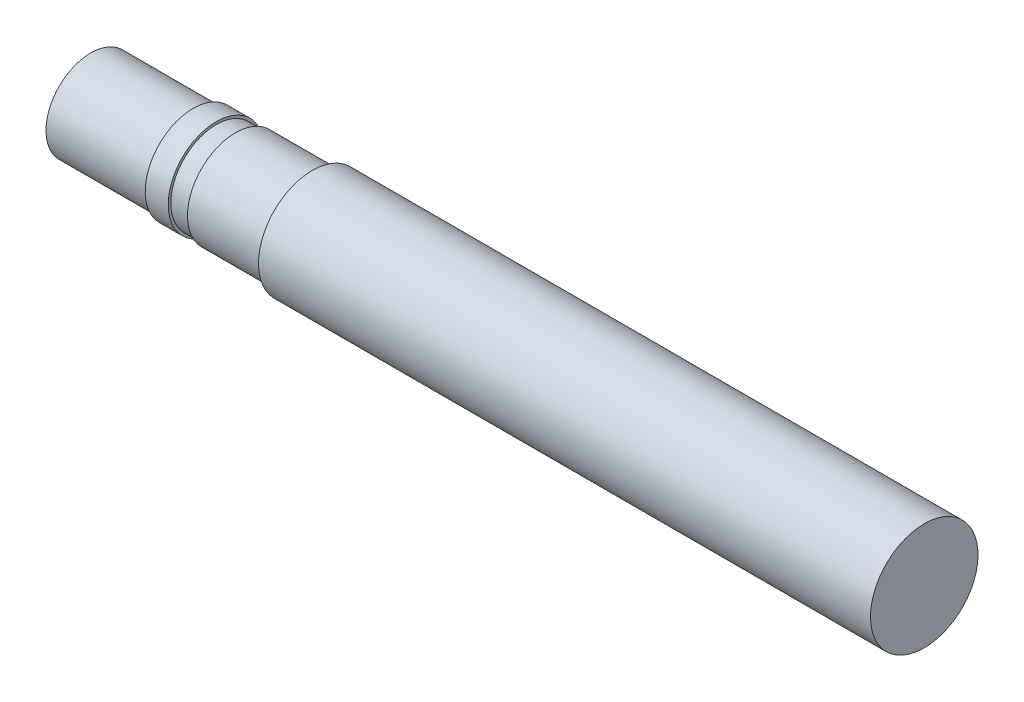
from build123d import *


with BuildPart() as part:
    # Sketch1 → Revolve1 (revolve)
    with BuildSketch(Plane.XY):
        Polygon((-571, 37.5), (-553, 37.5), (-553, 35.5), (-538, 35.5), (-538, 37.5), (-478, 37.5), (-478, 42), (0, 42), (0, 0), (-651, 0), (-651, 35), (-571, 35), align=None)
    revolve(axis=Axis((0, 0, 0), (-1, 0, 0)))


solid = part.part
